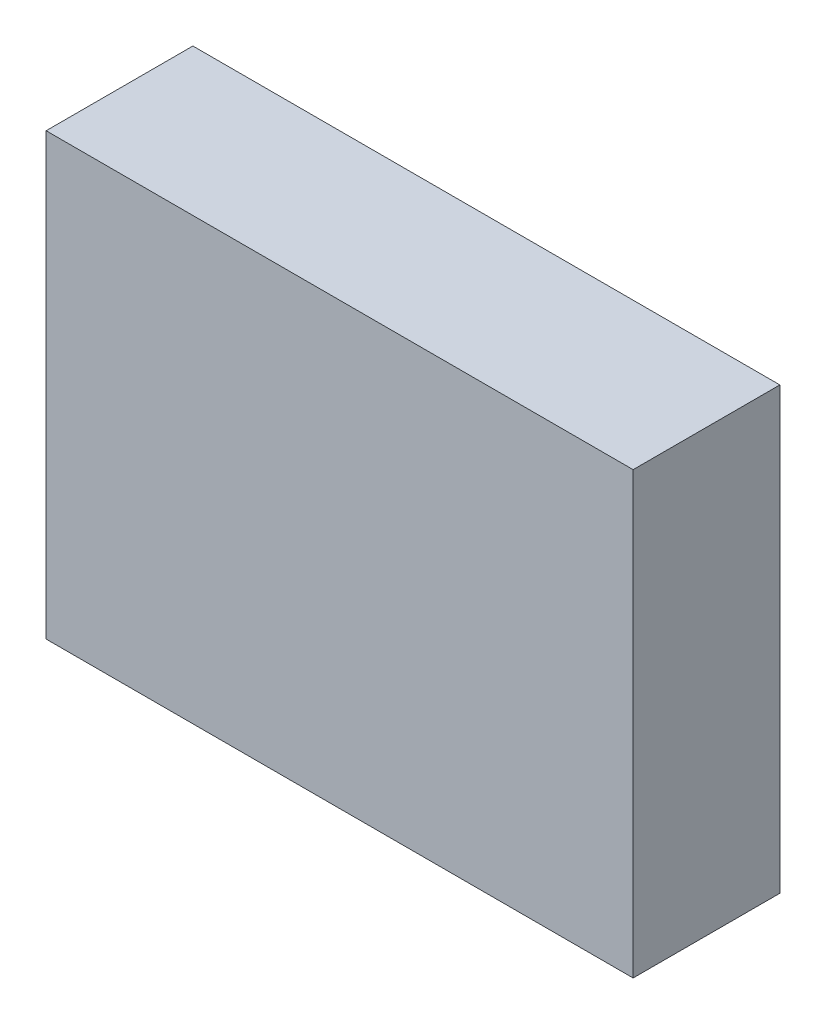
from build123d import *

# Parameters (mm, degrees)
ESQUISSE1_W      = 12
ESQUISSE1_H      = 9
EXTRUSION1_DEPTH = 3


with BuildPart() as part:
    # Esquisse1 → Extrusion1 (new body)
    with BuildSketch(Plane.XY):
        with Locations((6, 4.5)):
            Rectangle(ESQUISSE1_W, ESQUISSE1_H)
    extrude(amount=EXTRUSION1_DEPTH)


solid = part.part
